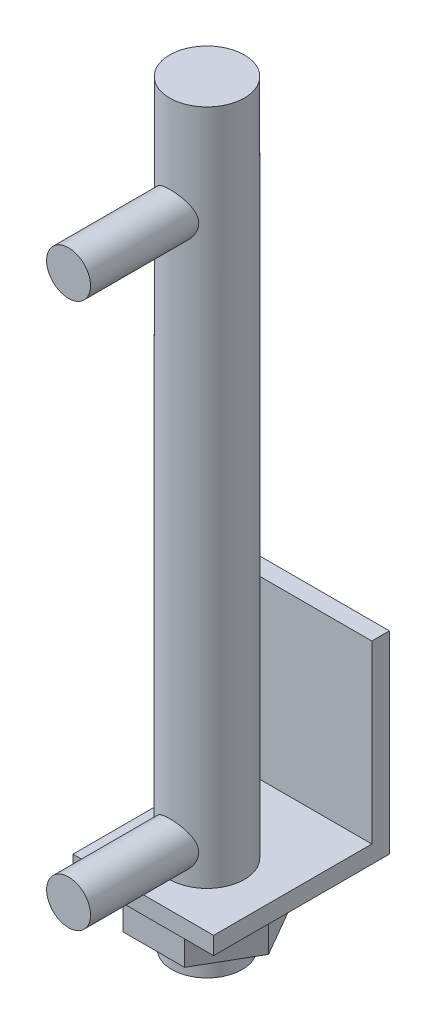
ISO-10303-21;
HEADER;
FILE_DESCRIPTION(('STEP AP214'),'2;1');
FILE_NAME('part.step','',(''),(''),'','','');
FILE_SCHEMA(('AUTOMOTIVE_DESIGN { 1 0 10303 214 1 1 1 1 }'));
ENDSEC;
DATA;
#1=APPLICATION_CONTEXT('core data for automotive mechanical design processes');
#2=APPLICATION_PROTOCOL_DEFINITION('international standard','automotive_design',2000,#1);
#3=PRODUCT_CONTEXT('',#1,'mechanical');
#4=PRODUCT('Part','Part','',(#3));
#5=PRODUCT_RELATED_PRODUCT_CATEGORY('part','',(#4));
#6=PRODUCT_DEFINITION_FORMATION('','',#4);
#7=PRODUCT_DEFINITION_CONTEXT('part definition',#1,'design');
#8=PRODUCT_DEFINITION('design','',#6,#7);
#9=PRODUCT_DEFINITION_SHAPE('','',#8);
#10=(LENGTH_UNIT() NAMED_UNIT(*) SI_UNIT(.MILLI.,.METRE.));
#11=(NAMED_UNIT(*) PLANE_ANGLE_UNIT() SI_UNIT($,.RADIAN.));
#12=(NAMED_UNIT(*) SI_UNIT($,.STERADIAN.) SOLID_ANGLE_UNIT());
#13=UNCERTAINTY_MEASURE_WITH_UNIT(LENGTH_MEASURE(1.E-05),#10,'distance_accuracy_value','');
#14=(GEOMETRIC_REPRESENTATION_CONTEXT(3) GLOBAL_UNCERTAINTY_ASSIGNED_CONTEXT((#13)) GLOBAL_UNIT_ASSIGNED_CONTEXT((#10,
#11,#12)) REPRESENTATION_CONTEXT('',''));
#15=CARTESIAN_POINT('',(0.,0.,0.));
#16=DIRECTION('',(0.,0.,1.));
#17=DIRECTION('',(1.,0.,0.));
#18=AXIS2_PLACEMENT_3D('',#15,#16,#17);
#19=CARTESIAN_POINT('',(0.,154.,0.));
#20=DIRECTION('',(0.,-1.,0.));
#21=DIRECTION('',(0.,0.,-1.));
#22=AXIS2_PLACEMENT_3D('',#19,#20,#21);
#23=CYLINDRICAL_SURFACE('',#22,8.5);
#24=CARTESIAN_POINT('',(-5.,7.,6.87386354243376));
#25=CARTESIAN_POINT('',(-5.00000015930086,6.87361152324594,6.87386328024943));
#26=CARTESIAN_POINT('',(-4.99520047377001,6.74722544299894,6.87736235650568));
#27=CARTESIAN_POINT('',(-4.97608962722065,6.49556010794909,6.89120233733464));
#28=CARTESIAN_POINT('',(-4.96177856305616,6.37028084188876,6.90154317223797));
#29=CARTESIAN_POINT('',(-4.92387022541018,6.12175760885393,6.92863932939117));
#30=CARTESIAN_POINT('',(-4.90026674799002,5.99851505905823,6.94539893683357));
#31=CARTESIAN_POINT('',(-4.84413070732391,5.75499473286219,6.98466632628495));
#32=CARTESIAN_POINT('',(-4.81159396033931,5.63471837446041,7.00717680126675));
#33=CARTESIAN_POINT('',(-4.70173229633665,5.28121872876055,7.0817754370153));
#34=CARTESIAN_POINT('',(-4.61183990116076,5.05331513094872,7.14117199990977));
#35=CARTESIAN_POINT('',(-4.40181230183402,4.61608744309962,7.2725046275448));
#36=CARTESIAN_POINT('',(-4.2816675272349,4.40676926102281,7.34444465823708));
#37=CARTESIAN_POINT('',(-3.9981483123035,3.98560780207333,7.50294471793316));
#38=CARTESIAN_POINT('',(-3.8313605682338,3.77633473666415,7.59023048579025));
#39=CARTESIAN_POINT('',(-3.46615404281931,3.38654010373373,7.76380092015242));
#40=CARTESIAN_POINT('',(-3.26771300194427,3.20603894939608,7.85008483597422));
#41=CARTESIAN_POINT('',(-2.93782109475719,2.95139729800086,7.97715958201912));
#42=CARTESIAN_POINT('',(-2.81619934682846,2.86584092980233,8.02101011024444));
#43=CARTESIAN_POINT('',(-2.56488101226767,2.70540031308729,8.10486891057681));
#44=CARTESIAN_POINT('',(-2.43518779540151,2.63051165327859,8.14487876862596));
#45=CARTESIAN_POINT('',(-2.16850723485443,2.49221443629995,8.21990024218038));
#46=CARTESIAN_POINT('',(-2.03152298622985,2.42880105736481,8.25491395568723));
#47=CARTESIAN_POINT('',(-1.75115979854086,2.31423880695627,8.31890005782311));
#48=CARTESIAN_POINT('',(-1.60778186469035,2.26308801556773,8.34787339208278));
#49=CARTESIAN_POINT('',(-1.32932369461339,2.17795757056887,8.39648677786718));
#50=CARTESIAN_POINT('',(-1.19470218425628,2.1428274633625,8.41674214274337));
#51=CARTESIAN_POINT('',(-0.922235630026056,2.08381209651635,8.45093624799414));
#52=CARTESIAN_POINT('',(-0.784391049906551,2.05992522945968,8.46487589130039));
#53=CARTESIAN_POINT('',(-0.506770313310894,2.02377998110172,8.48602091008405));
#54=CARTESIAN_POINT('',(-0.366995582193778,2.01151344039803,8.49323101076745));
#55=CARTESIAN_POINT('',(-0.086729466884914,1.99878518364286,8.50071301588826));
#56=CARTESIAN_POINT('',(0.0537618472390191,1.99832233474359,8.50098558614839));
#57=CARTESIAN_POINT('',(0.317330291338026,2.00855149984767,8.49497185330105));
#58=CARTESIAN_POINT('',(0.440479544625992,2.01791532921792,8.48946649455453));
#59=CARTESIAN_POINT('',(0.685443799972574,2.04567200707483,8.47320713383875));
#60=CARTESIAN_POINT('',(0.807258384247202,2.06406760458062,8.46245153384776));
#61=CARTESIAN_POINT('',(1.04863308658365,2.10965808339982,8.43594090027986));
#62=CARTESIAN_POINT('',(1.16819395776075,2.13684996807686,8.42018756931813));
#63=CARTESIAN_POINT('',(1.40436247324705,2.1997161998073,8.38403670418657));
#64=CARTESIAN_POINT('',(1.52096895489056,2.2353938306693,8.36363737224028));
#65=CARTESIAN_POINT('',(1.86684916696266,2.35515823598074,8.29579078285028));
#66=CARTESIAN_POINT('',(2.09069284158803,2.45169072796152,8.24186605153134));
#67=CARTESIAN_POINT('',(2.5191957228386,2.67425002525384,8.12116934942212));
#68=CARTESIAN_POINT('',(2.72384964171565,2.80028492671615,8.05439385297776));
#69=CARTESIAN_POINT('',(3.13396607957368,3.09497814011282,7.90450835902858));
#70=CARTESIAN_POINT('',(3.33672671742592,3.26689669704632,7.82040139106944));
#71=CARTESIAN_POINT('',(3.71219743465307,3.63996092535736,7.64933256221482));
#72=CARTESIAN_POINT('',(3.88486786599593,3.84114452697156,7.56236711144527));
#73=CARTESIAN_POINT('',(4.21435506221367,4.2934154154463,7.384303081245));
#74=CARTESIAN_POINT('',(4.36738665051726,4.54755257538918,7.29378878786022));
#75=CARTESIAN_POINT('',(4.56249844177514,4.94919813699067,7.17213498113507));
#76=CARTESIAN_POINT('',(4.62178663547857,5.08645227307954,7.13394390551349));
#77=CARTESIAN_POINT('',(4.72824603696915,5.36715673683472,7.06383370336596));
#78=CARTESIAN_POINT('',(4.77542179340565,5.51060471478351,7.03191222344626));
#79=CARTESIAN_POINT('',(4.84708756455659,5.76751548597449,6.98263217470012));
#80=CARTESIAN_POINT('',(4.87430483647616,5.87990928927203,6.96361723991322));
#81=CARTESIAN_POINT('',(4.92097885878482,6.10702902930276,6.93071316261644));
#82=CARTESIAN_POINT('',(4.94043724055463,6.22175447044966,6.91682294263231));
#83=CARTESIAN_POINT('',(4.97132228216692,6.45271802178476,6.89465862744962));
#84=CARTESIAN_POINT('',(4.98275607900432,6.56895469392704,6.88637954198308));
#85=CARTESIAN_POINT('',(4.99745325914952,6.80221976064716,6.87572137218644));
#86=CARTESIAN_POINT('',(5.00071645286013,6.91924817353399,6.87334242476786));
#87=CARTESIAN_POINT('',(4.99902030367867,7.15331083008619,6.87457613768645));
#88=CARTESIAN_POINT('',(4.99405412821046,7.27034499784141,6.87819377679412));
#89=CARTESIAN_POINT('',(4.97596011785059,7.50348698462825,6.89129481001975));
#90=CARTESIAN_POINT('',(4.96282929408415,7.61959444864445,6.90078035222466));
#91=CARTESIAN_POINT('',(4.92858602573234,7.85006638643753,6.92527848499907));
#92=CARTESIAN_POINT('',(4.90747135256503,7.96443036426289,6.94029261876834));
#93=CARTESIAN_POINT('',(4.8575385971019,8.1906985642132,6.97533099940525));
#94=CARTESIAN_POINT('',(4.82871739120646,8.30260176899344,6.99535727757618));
#95=CARTESIAN_POINT('',(4.73087760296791,8.63466281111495,7.06222982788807));
#96=CARTESIAN_POINT('',(4.65061879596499,8.85027628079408,7.11576680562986));
#97=CARTESIAN_POINT('',(4.46306838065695,9.26563262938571,7.23486753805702));
#98=CARTESIAN_POINT('',(4.35576623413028,9.46536928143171,7.30043597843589));
#99=CARTESIAN_POINT('',(4.09552588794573,9.88039621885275,7.45002972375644));
#100=CARTESIAN_POINT('',(3.93788949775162,10.092304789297,7.53527804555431));
#101=CARTESIAN_POINT('',(3.59127980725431,10.4888508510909,7.7064938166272));
#102=CARTESIAN_POINT('',(3.40227807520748,10.6734633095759,7.79246185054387));
#103=CARTESIAN_POINT('',(3.08561346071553,10.9371098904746,7.92111554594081));
#104=CARTESIAN_POINT('',(2.96763932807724,11.0268102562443,7.96617516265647));
#105=CARTESIAN_POINT('',(2.72336552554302,11.1958695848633,8.05295289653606));
#106=CARTESIAN_POINT('',(2.59706907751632,11.2752325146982,8.09467229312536));
#107=CARTESIAN_POINT('',(2.33684561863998,11.4228411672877,8.17359392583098));
#108=CARTESIAN_POINT('',(2.20292092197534,11.4910902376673,8.21079752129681));
#109=CARTESIAN_POINT('',(1.92826199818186,11.6156834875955,8.27960355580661));
#110=CARTESIAN_POINT('',(1.78752871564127,11.6720293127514,8.31120676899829));
#111=CARTESIAN_POINT('',(1.51137716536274,11.7681696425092,8.36564383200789));
#112=CARTESIAN_POINT('',(1.37638207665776,11.8089035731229,8.3889650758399));
#113=CARTESIAN_POINT('',(1.10255327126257,11.8789692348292,8.42932495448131));
#114=CARTESIAN_POINT('',(0.96372013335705,11.9083026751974,8.44636453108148));
#115=CARTESIAN_POINT('',(0.683518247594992,11.9550945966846,8.47364154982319));
#116=CARTESIAN_POINT('',(0.542151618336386,11.9725625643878,8.48388442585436));
#117=CARTESIAN_POINT('',(0.258114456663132,11.995364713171,8.49726907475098));
#118=CARTESIAN_POINT('',(0.115444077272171,12.0007003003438,8.50041167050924));
#119=CARTESIAN_POINT('',(-0.151711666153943,11.9992501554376,8.49955915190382));
#120=CARTESIAN_POINT('',(-0.276210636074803,11.9939146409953,8.49641799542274));
#121=CARTESIAN_POINT('',(-0.524249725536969,11.9739970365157,8.48472634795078));
#122=CARTESIAN_POINT('',(-0.647789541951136,11.9594121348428,8.47617421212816));
#123=CARTESIAN_POINT('',(-0.89293544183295,11.9211833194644,8.4538631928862));
#124=CARTESIAN_POINT('',(-1.01454223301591,11.8975428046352,8.44010626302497));
#125=CARTESIAN_POINT('',(-1.25507082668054,11.8414949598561,8.40770833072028));
#126=CARTESIAN_POINT('',(-1.37399157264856,11.809084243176,8.38906544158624));
#127=CARTESIAN_POINT('',(-1.72354346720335,11.6998431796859,8.32675827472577));
#128=CARTESIAN_POINT('',(-1.94927426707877,11.6106348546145,8.27649334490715));
#129=CARTESIAN_POINT('',(-2.38258507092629,11.4024109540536,8.16233248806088));
#130=CARTESIAN_POINT('',(-2.59016066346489,11.2833881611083,8.09843326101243));
#131=CARTESIAN_POINT('',(-3.00589419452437,11.0042439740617,7.95412679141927));
#132=CARTESIAN_POINT('',(-3.21162278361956,10.8410479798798,7.87267785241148));
#133=CARTESIAN_POINT('',(-3.59447885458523,10.4854095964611,7.70541511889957));
#134=CARTESIAN_POINT('',(-3.77157258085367,10.2929332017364,7.61959632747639));
#135=CARTESIAN_POINT('',(-4.02300871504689,9.9726656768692,7.48837711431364));
#136=CARTESIAN_POINT('',(-4.10824607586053,9.85373612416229,7.44182713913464));
#137=CARTESIAN_POINT('',(-4.26838282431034,9.608139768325,7.35114714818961));
#138=CARTESIAN_POINT('',(-4.34327960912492,9.48147102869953,7.30701774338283));
#139=CARTESIAN_POINT('',(-4.48203401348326,9.22106440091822,7.22273929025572));
#140=CARTESIAN_POINT('',(-4.54589842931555,9.08733093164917,7.1825877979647));
#141=CARTESIAN_POINT('',(-4.66191254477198,8.81346605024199,7.10783616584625));
#142=CARTESIAN_POINT('',(-4.71407062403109,8.67333930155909,7.0732320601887));
#143=CARTESIAN_POINT('',(-4.79920141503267,8.40856618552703,7.01568986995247));
#144=CARTESIAN_POINT('',(-4.83386750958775,8.28467365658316,6.99178455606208));
#145=CARTESIAN_POINT('',(-4.8936855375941,8.03366879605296,6.95004859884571));
#146=CARTESIAN_POINT('',(-4.91884309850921,7.90655841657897,6.93221436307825));
#147=CARTESIAN_POINT('',(-4.95924756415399,7.6501447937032,6.90336747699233));
#148=CARTESIAN_POINT('',(-4.97450547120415,7.52084414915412,6.8923472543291));
#149=CARTESIAN_POINT('',(-4.99488145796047,7.2610281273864,6.87759552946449));
#150=CARTESIAN_POINT('',(-4.99999983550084,7.13051278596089,6.87386381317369));
#151=CARTESIAN_POINT('',(-5.,7.,6.87386354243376));
#152=B_SPLINE_CURVE_WITH_KNOTS('',3,(#24,#25,#26,#27,#28,#29,#30,#31,#32,#33,#34,#35,#36,#37,
#38,#39,#40,#41,#42,#43,#44,#45,#46,#47,#48,#49,#50,#51,#52,#53,#54,#55,#56,#57,#58,#59,#60,#61,
#62,#63,#64,#65,#66,#67,#68,#69,#70,#71,#72,#73,#74,#75,#76,#77,#78,#79,#80,#81,#82,#83,#84,#85,
#86,#87,#88,#89,#90,#91,#92,#93,#94,#95,#96,#97,#98,#99,#100,#101,#102,#103,#104,#105,#106,#107,
#108,#109,#110,#111,#112,#113,#114,#115,#116,#117,#118,#119,#120,#121,#122,#123,#124,#125,#126,
#127,#128,#129,#130,#131,#132,#133,#134,#135,#136,#137,#138,#139,#140,#141,#142,#143,#144,#145,
#146,#147,#148,#149,#150,#151),.UNSPECIFIED.,.T.,.F.,(4,2,2,2,2,2,2,2,2,2,2,2,2,2,2,2,2,2,2,2,2,
2,2,2,2,2,2,2,2,2,2,2,2,2,2,2,2,2,2,2,2,2,2,2,2,2,2,2,2,2,2,2,2,2,2,2,2,2,2,2,2,2,2,4),(0.,
0.379023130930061,0.758042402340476,1.13731515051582,1.51676582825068,2.26959953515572,
3.02267170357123,3.86385803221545,4.70563853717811,5.17020411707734,5.63457702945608,
6.09875436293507,6.56285897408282,6.98404701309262,7.40517481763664,7.82600670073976,
8.24679819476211,8.61723697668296,8.98778857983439,9.35821407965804,9.72878316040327,
10.4744507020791,11.2203231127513,12.0533830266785,12.8875324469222,13.8126919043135,
14.2750562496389,14.7372467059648,15.0884778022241,15.439635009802,15.7904795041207,
16.1413321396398,16.4924762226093,16.84374892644,17.1951197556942,17.5466332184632,
18.2523650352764,18.9583722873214,19.7877574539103,20.6178985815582,21.0820898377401,
21.5461024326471,22.00997500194,22.4737833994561,22.9019345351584,23.330021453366,
23.757765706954,24.1854603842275,24.5589622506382,24.9325777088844,25.3060530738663,
25.6796728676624,26.4199474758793,27.160401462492,27.9820049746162,28.8045700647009,
29.2647382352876,29.725022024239,30.1850212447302,30.6446901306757,31.0367616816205,
31.4286008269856,31.8200037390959,32.2113951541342),.UNSPECIFIED.);
#153=CARTESIAN_POINT('',(-5.,7.,6.87386354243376));
#154=VERTEX_POINT('',#153);
#155=EDGE_CURVE('E42',#154,#154,#152,.T.);
#156=ORIENTED_EDGE('',*,*,#155,.F.);
#157=EDGE_LOOP('',(#156));
#158=FACE_BOUND('',#157,.T.);
#159=CARTESIAN_POINT('',(0.,154.,0.));
#160=DIRECTION('',(0.,1.,0.));
#161=DIRECTION('',(0.,0.,1.));
#162=AXIS2_PLACEMENT_3D('',#159,#160,#161);
#163=CIRCLE('',#162,8.5);
#164=CARTESIAN_POINT('',(0.,154.,8.5));
#165=VERTEX_POINT('',#164);
#166=EDGE_CURVE('E200',#165,#165,#163,.T.);
#167=ORIENTED_EDGE('',*,*,#166,.F.);
#168=EDGE_LOOP('',(#167));
#169=FACE_BOUND('',#168,.T.);
#170=CARTESIAN_POINT('',(0.,0.,0.));
#171=DIRECTION('',(0.,-1.,0.));
#172=DIRECTION('',(0.,0.,-1.));
#173=AXIS2_PLACEMENT_3D('',#170,#171,#172);
#174=CIRCLE('',#173,8.5);
#175=CARTESIAN_POINT('',(0.,0.,-8.5));
#176=VERTEX_POINT('',#175);
#177=EDGE_CURVE('E197',#176,#176,#174,.T.);
#178=ORIENTED_EDGE('',*,*,#177,.F.);
#179=EDGE_LOOP('',(#178));
#180=FACE_BOUND('',#179,.T.);
#181=CARTESIAN_POINT('',(-5.,131.,6.87386354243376));
#182=CARTESIAN_POINT('',(-5.00000015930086,130.873611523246,6.87386328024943));
#183=CARTESIAN_POINT('',(-4.99520047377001,130.747225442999,6.87736235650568));
#184=CARTESIAN_POINT('',(-4.97608962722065,130.495560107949,6.89120233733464));
#185=CARTESIAN_POINT('',(-4.96177856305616,130.370280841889,6.90154317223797));
#186=CARTESIAN_POINT('',(-4.92387022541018,130.121757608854,6.92863932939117));
#187=CARTESIAN_POINT('',(-4.90026674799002,129.998515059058,6.94539893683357));
#188=CARTESIAN_POINT('',(-4.84413070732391,129.754994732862,6.98466632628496));
#189=CARTESIAN_POINT('',(-4.8115939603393,129.63471837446,7.00717680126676));
#190=CARTESIAN_POINT('',(-4.70173229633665,129.281218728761,7.0817754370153));
#191=CARTESIAN_POINT('',(-4.61183990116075,129.053315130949,7.14117199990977));
#192=CARTESIAN_POINT('',(-4.40181230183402,128.6160874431,7.2725046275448));
#193=CARTESIAN_POINT('',(-4.2816675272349,128.406769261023,7.34444465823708));
#194=CARTESIAN_POINT('',(-3.99814831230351,127.985607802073,7.50294471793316));
#195=CARTESIAN_POINT('',(-3.83136056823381,127.776334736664,7.59023048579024));
#196=CARTESIAN_POINT('',(-3.46615404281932,127.386540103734,7.76380092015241));
#197=CARTESIAN_POINT('',(-3.26771300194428,127.206038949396,7.85008483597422));
#198=CARTESIAN_POINT('',(-2.93782109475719,126.951397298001,7.97715958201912));
#199=CARTESIAN_POINT('',(-2.81619934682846,126.865840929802,8.02101011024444));
#200=CARTESIAN_POINT('',(-2.56488101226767,126.705400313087,8.10486891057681));
#201=CARTESIAN_POINT('',(-2.43518779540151,126.630511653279,8.14487876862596));
#202=CARTESIAN_POINT('',(-2.16850723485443,126.4922144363,8.21990024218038));
#203=CARTESIAN_POINT('',(-2.03152298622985,126.428801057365,8.25491395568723));
#204=CARTESIAN_POINT('',(-1.75115979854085,126.314238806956,8.31890005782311));
#205=CARTESIAN_POINT('',(-1.60778186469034,126.263088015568,8.34787339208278));
#206=CARTESIAN_POINT('',(-1.32932369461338,126.177957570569,8.39648677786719));
#207=CARTESIAN_POINT('',(-1.19470218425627,126.142827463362,8.41674214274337));
#208=CARTESIAN_POINT('',(-0.922235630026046,126.083812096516,8.45093624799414));
#209=CARTESIAN_POINT('',(-0.784391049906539,126.05992522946,8.4648758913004));
#210=CARTESIAN_POINT('',(-0.506770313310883,126.023779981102,8.48602091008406));
#211=CARTESIAN_POINT('',(-0.366995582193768,126.011513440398,8.49323101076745));
#212=CARTESIAN_POINT('',(-0.0867294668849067,125.998785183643,8.50071301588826));
#213=CARTESIAN_POINT('',(0.0537618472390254,125.998322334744,8.50098558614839));
#214=CARTESIAN_POINT('',(0.317330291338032,126.008551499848,8.49497185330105));
#215=CARTESIAN_POINT('',(0.440479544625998,126.017915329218,8.48946649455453));
#216=CARTESIAN_POINT('',(0.68544379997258,126.045672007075,8.47320713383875));
#217=CARTESIAN_POINT('',(0.807258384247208,126.064067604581,8.46245153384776));
#218=CARTESIAN_POINT('',(1.04863308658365,126.1096580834,8.43594090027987));
#219=CARTESIAN_POINT('',(1.16819395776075,126.136849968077,8.42018756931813));
#220=CARTESIAN_POINT('',(1.40436247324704,126.199716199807,8.38403670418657));
#221=CARTESIAN_POINT('',(1.52096895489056,126.235393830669,8.36363737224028));
#222=CARTESIAN_POINT('',(1.86684916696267,126.355158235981,8.29579078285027));
#223=CARTESIAN_POINT('',(2.09069284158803,126.451690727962,8.24186605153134));
#224=CARTESIAN_POINT('',(2.5191957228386,126.674250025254,8.12116934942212));
#225=CARTESIAN_POINT('',(2.72384964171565,126.800284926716,8.05439385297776));
#226=CARTESIAN_POINT('',(3.13396607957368,127.094978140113,7.90450835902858));
#227=CARTESIAN_POINT('',(3.33672671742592,127.266896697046,7.82040139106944));
#228=CARTESIAN_POINT('',(3.71219743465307,127.639960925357,7.64933256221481));
#229=CARTESIAN_POINT('',(3.88486786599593,127.841144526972,7.56236711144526));
#230=CARTESIAN_POINT('',(4.21435506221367,128.293415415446,7.384303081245));
#231=CARTESIAN_POINT('',(4.36738665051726,128.547552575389,7.29378878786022));
#232=CARTESIAN_POINT('',(4.56249844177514,128.949198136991,7.17213498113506));
#233=CARTESIAN_POINT('',(4.62178663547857,129.08645227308,7.13394390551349));
#234=CARTESIAN_POINT('',(4.72824603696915,129.367156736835,7.06383370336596));
#235=CARTESIAN_POINT('',(4.77542179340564,129.510604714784,7.03191222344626));
#236=CARTESIAN_POINT('',(4.84708756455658,129.767515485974,6.98263217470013));
#237=CARTESIAN_POINT('',(4.87430483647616,129.879909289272,6.96361723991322));
#238=CARTESIAN_POINT('',(4.92097885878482,130.107029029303,6.93071316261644));
#239=CARTESIAN_POINT('',(4.94043724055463,130.22175447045,6.91682294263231));
#240=CARTESIAN_POINT('',(4.97132228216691,130.452718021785,6.89465862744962));
#241=CARTESIAN_POINT('',(4.98275607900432,130.568954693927,6.88637954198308));
#242=CARTESIAN_POINT('',(4.99745325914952,130.802219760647,6.87572137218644));
#243=CARTESIAN_POINT('',(5.00071645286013,130.919248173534,6.87334242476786));
#244=CARTESIAN_POINT('',(4.99902030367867,131.153310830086,6.87457613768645));
#245=CARTESIAN_POINT('',(4.99405412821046,131.270344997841,6.87819377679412));
#246=CARTESIAN_POINT('',(4.97596011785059,131.503486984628,6.89129481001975));
#247=CARTESIAN_POINT('',(4.96282929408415,131.619594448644,6.90078035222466));
#248=CARTESIAN_POINT('',(4.92858602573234,131.850066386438,6.92527848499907));
#249=CARTESIAN_POINT('',(4.90747135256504,131.964430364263,6.94029261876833));
#250=CARTESIAN_POINT('',(4.85753859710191,132.190698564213,6.97533099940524));
#251=CARTESIAN_POINT('',(4.82871739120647,132.302601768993,6.99535727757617));
#252=CARTESIAN_POINT('',(4.73087760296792,132.634662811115,7.06222982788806));
#253=CARTESIAN_POINT('',(4.650618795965,132.850276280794,7.11576680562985));
#254=CARTESIAN_POINT('',(4.46306838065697,133.265632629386,7.23486753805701));
#255=CARTESIAN_POINT('',(4.35576623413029,133.465369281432,7.30043597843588));
#256=CARTESIAN_POINT('',(4.09552588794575,133.880396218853,7.45002972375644));
#257=CARTESIAN_POINT('',(3.93788949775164,134.092304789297,7.53527804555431));
#258=CARTESIAN_POINT('',(3.59127980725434,134.488850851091,7.70649381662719));
#259=CARTESIAN_POINT('',(3.40227807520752,134.673463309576,7.79246185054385));
#260=CARTESIAN_POINT('',(3.08561346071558,134.937109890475,7.9211155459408));
#261=CARTESIAN_POINT('',(2.96763932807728,135.026810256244,7.96617516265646));
#262=CARTESIAN_POINT('',(2.72336552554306,135.195869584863,8.05295289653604));
#263=CARTESIAN_POINT('',(2.59706907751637,135.275232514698,8.09467229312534));
#264=CARTESIAN_POINT('',(2.33684561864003,135.422841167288,8.17359392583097));
#265=CARTESIAN_POINT('',(2.20292092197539,135.491090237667,8.2107975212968));
#266=CARTESIAN_POINT('',(1.92826199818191,135.615683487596,8.2796035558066));
#267=CARTESIAN_POINT('',(1.78752871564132,135.672029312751,8.31120676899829));
#268=CARTESIAN_POINT('',(1.51137716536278,135.768169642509,8.36564383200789));
#269=CARTESIAN_POINT('',(1.3763820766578,135.808903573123,8.38896507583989));
#270=CARTESIAN_POINT('',(1.10255327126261,135.878969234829,8.4293249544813));
#271=CARTESIAN_POINT('',(0.963720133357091,135.908302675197,8.44636453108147));
#272=CARTESIAN_POINT('',(0.68351824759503,135.955094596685,8.47364154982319));
#273=CARTESIAN_POINT('',(0.542151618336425,135.972562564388,8.48388442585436));
#274=CARTESIAN_POINT('',(0.25811445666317,135.995364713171,8.49726907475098));
#275=CARTESIAN_POINT('',(0.115444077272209,136.000700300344,8.50041167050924));
#276=CARTESIAN_POINT('',(-0.151711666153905,135.999250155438,8.49955915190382));
#277=CARTESIAN_POINT('',(-0.276210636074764,135.993914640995,8.49641799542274));
#278=CARTESIAN_POINT('',(-0.524249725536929,135.973997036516,8.48472634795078));
#279=CARTESIAN_POINT('',(-0.647789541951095,135.959412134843,8.47617421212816));
#280=CARTESIAN_POINT('',(-0.892935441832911,135.921183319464,8.4538631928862));
#281=CARTESIAN_POINT('',(-1.01454223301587,135.897542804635,8.44010626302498));
#282=CARTESIAN_POINT('',(-1.25507082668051,135.841494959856,8.40770833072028));
#283=CARTESIAN_POINT('',(-1.37399157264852,135.809084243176,8.38906544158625));
#284=CARTESIAN_POINT('',(-1.72354346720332,135.699843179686,8.32675827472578));
#285=CARTESIAN_POINT('',(-1.94927426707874,135.610634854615,8.27649334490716));
#286=CARTESIAN_POINT('',(-2.38258507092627,135.402410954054,8.16233248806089));
#287=CARTESIAN_POINT('',(-2.59016066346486,135.283388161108,8.09843326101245));
#288=CARTESIAN_POINT('',(-3.00589419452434,135.004243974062,7.95412679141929));
#289=CARTESIAN_POINT('',(-3.21162278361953,134.84104797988,7.87267785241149));
#290=CARTESIAN_POINT('',(-3.5944788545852,134.485409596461,7.70541511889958));
#291=CARTESIAN_POINT('',(-3.77157258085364,134.292933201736,7.61959632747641));
#292=CARTESIAN_POINT('',(-4.02300871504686,133.972665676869,7.48837711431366));
#293=CARTESIAN_POINT('',(-4.1082460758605,133.853736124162,7.44182713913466));
#294=CARTESIAN_POINT('',(-4.26838282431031,133.608139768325,7.35114714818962));
#295=CARTESIAN_POINT('',(-4.3432796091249,133.4814710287,7.30701774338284));
#296=CARTESIAN_POINT('',(-4.48203401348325,133.221064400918,7.22273929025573));
#297=CARTESIAN_POINT('',(-4.54589842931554,133.087330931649,7.18258779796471));
#298=CARTESIAN_POINT('',(-4.66191254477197,132.813466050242,7.10783616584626));
#299=CARTESIAN_POINT('',(-4.71407062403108,132.673339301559,7.07323206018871));
#300=CARTESIAN_POINT('',(-4.79920141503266,132.408566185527,7.01568986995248));
#301=CARTESIAN_POINT('',(-4.83386750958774,132.284673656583,6.99178455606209));
#302=CARTESIAN_POINT('',(-4.89368553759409,132.033668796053,6.95004859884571));
#303=CARTESIAN_POINT('',(-4.91884309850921,131.906558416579,6.93221436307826));
#304=CARTESIAN_POINT('',(-4.95924756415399,131.650144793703,6.90336747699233));
#305=CARTESIAN_POINT('',(-4.97450547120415,131.520844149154,6.8923472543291));
#306=CARTESIAN_POINT('',(-4.99488145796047,131.261028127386,6.87759552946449));
#307=CARTESIAN_POINT('',(-4.99999983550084,131.130512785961,6.87386381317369));
#308=CARTESIAN_POINT('',(-5.,131.,6.87386354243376));
#309=B_SPLINE_CURVE_WITH_KNOTS('',3,(#181,#182,#183,#184,#185,#186,#187,#188,#189,#190,#191,
#192,#193,#194,#195,#196,#197,#198,#199,#200,#201,#202,#203,#204,#205,#206,#207,#208,#209,#210,
#211,#212,#213,#214,#215,#216,#217,#218,#219,#220,#221,#222,#223,#224,#225,#226,#227,#228,#229,
#230,#231,#232,#233,#234,#235,#236,#237,#238,#239,#240,#241,#242,#243,#244,#245,#246,#247,#248,
#249,#250,#251,#252,#253,#254,#255,#256,#257,#258,#259,#260,#261,#262,#263,#264,#265,#266,#267,
#268,#269,#270,#271,#272,#273,#274,#275,#276,#277,#278,#279,#280,#281,#282,#283,#284,#285,#286,
#287,#288,#289,#290,#291,#292,#293,#294,#295,#296,#297,#298,#299,#300,#301,#302,#303,#304,#305,
#306,#307,#308),.UNSPECIFIED.,.T.,.F.,(4,2,2,2,2,2,2,2,2,2,2,2,2,2,2,2,2,2,2,2,2,2,2,2,2,2,2,2,
2,2,2,2,2,2,2,2,2,2,2,2,2,2,2,2,2,2,2,2,2,2,2,2,2,2,2,2,2,2,2,2,2,2,2,4),(0.,0.379023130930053,
0.758042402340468,1.13731515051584,1.51676582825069,2.26959953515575,3.02267170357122,
3.86385803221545,4.7056385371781,5.17020411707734,5.63457702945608,6.09875436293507,
6.56285897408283,6.98404701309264,7.40517481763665,7.82600670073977,8.24679819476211,
8.61723697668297,8.98778857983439,9.35821407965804,9.72878316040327,10.4744507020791,
11.2203231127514,12.0533830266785,12.8875324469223,13.8126919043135,14.2750562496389,
14.7372467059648,15.0884778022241,15.439635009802,15.7904795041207,16.1413321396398,
16.4924762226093,16.8437489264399,17.1951197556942,17.5466332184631,18.2523650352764,
18.9583722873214,19.7877574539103,20.6178985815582,21.0820898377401,21.546102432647,
22.00997500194,22.473783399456,22.9019345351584,23.3300214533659,23.757765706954,
24.1854603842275,24.5589622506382,24.9325777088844,25.3060530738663,25.6796728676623,
26.4199474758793,27.160401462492,27.9820049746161,28.8045700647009,29.2647382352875,
29.725022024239,30.1850212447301,30.6446901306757,31.0367616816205,31.4286008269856,
31.8200037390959,32.2113951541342),.UNSPECIFIED.);
#310=CARTESIAN_POINT('',(-5.,131.,6.87386354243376));
#311=VERTEX_POINT('',#310);
#312=EDGE_CURVE('E11',#311,#311,#309,.T.);
#313=ORIENTED_EDGE('',*,*,#312,.F.);
#314=EDGE_LOOP('',(#313));
#315=FACE_BOUND('',#314,.T.);
#316=ADVANCED_FACE('F31',(#158,#169,#180,#315),#23,.T.);
#317=CARTESIAN_POINT('',(14.,-12.,0.));
#318=DIRECTION('',(0.,-1.,0.));
#319=DIRECTION('',(0.,0.,-1.));
#320=AXIS2_PLACEMENT_3D('',#317,#318,#319);
#321=PLANE('',#320);
#322=DIRECTION('',(0.5,0.,0.866025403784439));
#323=VECTOR('',#322,1.);
#324=CARTESIAN_POINT('',(7.,-12.,-12.1243556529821));
#325=LINE('',#324,#323);
#326=CARTESIAN_POINT('',(7.,-12.,-12.1243556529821));
#327=VERTEX_POINT('',#326);
#328=CARTESIAN_POINT('',(14.,-12.,0.));
#329=VERTEX_POINT('',#328);
#330=EDGE_CURVE('E135',#327,#329,#325,.T.);
#331=ORIENTED_EDGE('',*,*,#330,.T.);
#332=DIRECTION('',(-0.5,0.,0.866025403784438));
#333=VECTOR('',#332,1.);
#334=CARTESIAN_POINT('',(14.,-12.,0.));
#335=LINE('',#334,#333);
#336=CARTESIAN_POINT('',(6.99999999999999,-12.,12.1243556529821));
#337=VERTEX_POINT('',#336);
#338=EDGE_CURVE('E124',#329,#337,#335,.T.);
#339=ORIENTED_EDGE('',*,*,#338,.T.);
#340=DIRECTION('',(-1.,0.,0.));
#341=VECTOR('',#340,1.);
#342=CARTESIAN_POINT('',(6.99999999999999,-12.,12.1243556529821));
#343=LINE('',#342,#341);
#344=CARTESIAN_POINT('',(-7.,-12.,12.1243556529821));
#345=VERTEX_POINT('',#344);
#346=EDGE_CURVE('E134',#337,#345,#343,.T.);
#347=ORIENTED_EDGE('',*,*,#346,.T.);
#348=DIRECTION('',(-0.5,0.,-0.866025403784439));
#349=VECTOR('',#348,1.);
#350=CARTESIAN_POINT('',(-7.,-12.,12.1243556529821));
#351=LINE('',#350,#349);
#352=CARTESIAN_POINT('',(-14.,-12.,0.));
#353=VERTEX_POINT('',#352);
#354=EDGE_CURVE('E316',#345,#353,#351,.T.);
#355=ORIENTED_EDGE('',*,*,#354,.T.);
#356=DIRECTION('',(0.5,0.,-0.866025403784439));
#357=VECTOR('',#356,1.);
#358=CARTESIAN_POINT('',(-14.,-12.,0.));
#359=LINE('',#358,#357);
#360=CARTESIAN_POINT('',(-7.,-12.,-12.1243556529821));
#361=VERTEX_POINT('',#360);
#362=EDGE_CURVE('E318',#353,#361,#359,.T.);
#363=ORIENTED_EDGE('',*,*,#362,.T.);
#364=DIRECTION('',(1.,0.,0.));
#365=VECTOR('',#364,1.);
#366=CARTESIAN_POINT('',(-7.,-12.,-12.1243556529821));
#367=LINE('',#366,#365);
#368=EDGE_CURVE('E140',#361,#327,#367,.T.);
#369=ORIENTED_EDGE('',*,*,#368,.T.);
#370=EDGE_LOOP('',(#331,#339,#347,#355,#363,#369));
#371=FACE_BOUND('',#370,.T.);
#372=CARTESIAN_POINT('',(0.,-12.,0.));
#373=DIRECTION('',(0.,-1.,0.));
#374=DIRECTION('',(0.,0.,-1.));
#375=AXIS2_PLACEMENT_3D('',#372,#373,#374);
#376=CIRCLE('',#375,8.);
#377=CARTESIAN_POINT('',(0.,-12.,-8.));
#378=VERTEX_POINT('',#377);
#379=EDGE_CURVE('E203',#378,#378,#376,.F.);
#380=ORIENTED_EDGE('',*,*,#379,.T.);
#381=EDGE_LOOP('',(#380));
#382=FACE_BOUND('',#381,.T.);
#383=ADVANCED_FACE('F138',(#371,#382),#321,.T.);
#384=CARTESIAN_POINT('',(-16.,-4.,-25.5));
#385=DIRECTION('',(0.,-1.,0.));
#386=DIRECTION('',(0.,0.,-1.));
#387=AXIS2_PLACEMENT_3D('',#384,#385,#386);
#388=PLANE('',#387);
#389=DIRECTION('',(0.,0.,-1.));
#390=VECTOR('',#389,1.);
#391=CARTESIAN_POINT('',(-16.,-4.,14.5));
#392=LINE('',#391,#390);
#393=CARTESIAN_POINT('',(-16.,-4.,14.5));
#394=VERTEX_POINT('',#393);
#395=CARTESIAN_POINT('',(-16.,-4.,-25.5));
#396=VERTEX_POINT('',#395);
#397=EDGE_CURVE('E172',#394,#396,#392,.T.);
#398=ORIENTED_EDGE('',*,*,#397,.T.);
#399=DIRECTION('',(1.,0.,0.));
#400=VECTOR('',#399,1.);
#401=CARTESIAN_POINT('',(-16.,-4.,-25.5));
#402=LINE('',#401,#400);
#403=CARTESIAN_POINT('',(16.,-4.,-25.5));
#404=VERTEX_POINT('',#403);
#405=EDGE_CURVE('E175',#396,#404,#402,.T.);
#406=ORIENTED_EDGE('',*,*,#405,.T.);
#407=DIRECTION('',(0.,0.,1.));
#408=VECTOR('',#407,1.);
#409=CARTESIAN_POINT('',(16.,-4.,14.5));
#410=LINE('',#409,#408);
#411=CARTESIAN_POINT('',(16.,-4.,14.5));
#412=VERTEX_POINT('',#411);
#413=EDGE_CURVE('E178',#404,#412,#410,.T.);
#414=ORIENTED_EDGE('',*,*,#413,.T.);
#415=DIRECTION('',(-1.,0.,0.));
#416=VECTOR('',#415,1.);
#417=CARTESIAN_POINT('',(-16.,-4.,14.5));
#418=LINE('',#417,#416);
#419=EDGE_CURVE('E180',#412,#394,#418,.T.);
#420=ORIENTED_EDGE('',*,*,#419,.T.);
#421=EDGE_LOOP('',(#398,#406,#414,#420));
#422=FACE_BOUND('',#421,.T.);
#423=DIRECTION('',(-0.5,0.,0.866025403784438));
#424=VECTOR('',#423,1.);
#425=CARTESIAN_POINT('',(14.,-4.,0.));
#426=LINE('',#425,#424);
#427=CARTESIAN_POINT('',(14.,-4.,0.));
#428=VERTEX_POINT('',#427);
#429=CARTESIAN_POINT('',(6.99999999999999,-4.,12.1243556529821));
#430=VERTEX_POINT('',#429);
#431=EDGE_CURVE('E323',#428,#430,#426,.T.);
#432=ORIENTED_EDGE('',*,*,#431,.F.);
#433=DIRECTION('',(0.5,0.,0.866025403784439));
#434=VECTOR('',#433,1.);
#435=CARTESIAN_POINT('',(7.,-4.,-12.1243556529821));
#436=LINE('',#435,#434);
#437=CARTESIAN_POINT('',(7.,-4.,-12.1243556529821));
#438=VERTEX_POINT('',#437);
#439=EDGE_CURVE('E148',#438,#428,#436,.T.);
#440=ORIENTED_EDGE('',*,*,#439,.F.);
#441=DIRECTION('',(1.,0.,0.));
#442=VECTOR('',#441,1.);
#443=CARTESIAN_POINT('',(-7.,-4.,-12.1243556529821));
#444=LINE('',#443,#442);
#445=CARTESIAN_POINT('',(-7.,-4.,-12.1243556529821));
#446=VERTEX_POINT('',#445);
#447=EDGE_CURVE('E144',#446,#438,#444,.T.);
#448=ORIENTED_EDGE('',*,*,#447,.F.);
#449=DIRECTION('',(0.5,0.,-0.866025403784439));
#450=VECTOR('',#449,1.);
#451=CARTESIAN_POINT('',(-14.,-4.,0.));
#452=LINE('',#451,#450);
#453=CARTESIAN_POINT('',(-14.,-4.,0.));
#454=VERTEX_POINT('',#453);
#455=EDGE_CURVE('E329',#454,#446,#452,.T.);
#456=ORIENTED_EDGE('',*,*,#455,.F.);
#457=DIRECTION('',(-0.5,0.,-0.866025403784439));
#458=VECTOR('',#457,1.);
#459=CARTESIAN_POINT('',(-7.,-4.,12.1243556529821));
#460=LINE('',#459,#458);
#461=CARTESIAN_POINT('',(-7.,-4.,12.1243556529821));
#462=VERTEX_POINT('',#461);
#463=EDGE_CURVE('E327',#462,#454,#460,.T.);
#464=ORIENTED_EDGE('',*,*,#463,.F.);
#465=DIRECTION('',(-1.,0.,0.));
#466=VECTOR('',#465,1.);
#467=CARTESIAN_POINT('',(6.99999999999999,-4.,12.1243556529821));
#468=LINE('',#467,#466);
#469=EDGE_CURVE('E325',#430,#462,#468,.T.);
#470=ORIENTED_EDGE('',*,*,#469,.F.);
#471=EDGE_LOOP('',(#432,#440,#448,#456,#464,#470));
#472=FACE_BOUND('',#471,.T.);
#473=ADVANCED_FACE('F228',(#422,#472),#388,.T.);
#474=CARTESIAN_POINT('',(-16.,0.,-25.5));
#475=DIRECTION('',(0.,-1.,0.));
#476=DIRECTION('',(0.,0.,-1.));
#477=AXIS2_PLACEMENT_3D('',#474,#475,#476);
#478=PLANE('',#477);
#479=ORIENTED_EDGE('',*,*,#177,.T.);
#480=EDGE_LOOP('',(#479));
#481=FACE_BOUND('',#480,.T.);
#482=DIRECTION('',(1.,0.,0.));
#483=VECTOR('',#482,1.);
#484=CARTESIAN_POINT('',(-16.,0.,-21.5));
#485=LINE('',#484,#483);
#486=CARTESIAN_POINT('',(-16.,0.,-21.5));
#487=VERTEX_POINT('',#486);
#488=CARTESIAN_POINT('',(16.,0.,-21.5));
#489=VERTEX_POINT('',#488);
#490=EDGE_CURVE('E150',#487,#489,#485,.T.);
#491=ORIENTED_EDGE('',*,*,#490,.F.);
#492=DIRECTION('',(0.,0.,-1.));
#493=VECTOR('',#492,1.);
#494=CARTESIAN_POINT('',(-16.,0.,14.5));
#495=LINE('',#494,#493);
#496=CARTESIAN_POINT('',(-16.,0.,14.5));
#497=VERTEX_POINT('',#496);
#498=EDGE_CURVE('E171',#497,#487,#495,.T.);
#499=ORIENTED_EDGE('',*,*,#498,.F.);
#500=DIRECTION('',(-1.,0.,0.));
#501=VECTOR('',#500,1.);
#502=CARTESIAN_POINT('',(-16.,0.,14.5));
#503=LINE('',#502,#501);
#504=CARTESIAN_POINT('',(16.,0.,14.5));
#505=VERTEX_POINT('',#504);
#506=EDGE_CURVE('E176',#505,#497,#503,.T.);
#507=ORIENTED_EDGE('',*,*,#506,.F.);
#508=DIRECTION('',(0.,0.,1.));
#509=VECTOR('',#508,1.);
#510=CARTESIAN_POINT('',(16.,0.,14.5));
#511=LINE('',#510,#509);
#512=EDGE_CURVE('E185',#489,#505,#511,.T.);
#513=ORIENTED_EDGE('',*,*,#512,.F.);
#514=EDGE_LOOP('',(#491,#499,#507,#513));
#515=FACE_BOUND('',#514,.T.);
#516=ADVANCED_FACE('F258',(#481,#515),#478,.F.);
#517=CARTESIAN_POINT('',(0.,154.,0.));
#518=DIRECTION('',(0.,1.,0.));
#519=DIRECTION('',(0.,0.,1.));
#520=AXIS2_PLACEMENT_3D('',#517,#518,#519);
#521=PLANE('',#520);
#522=ORIENTED_EDGE('',*,*,#166,.T.);
#523=EDGE_LOOP('',(#522));
#524=FACE_BOUND('',#523,.T.);
#525=ADVANCED_FACE('F262',(#524),#521,.T.);
#526=CARTESIAN_POINT('',(-16.,-4.,14.5));
#527=DIRECTION('',(1.,0.,0.));
#528=DIRECTION('',(0.,0.,-1.));
#529=AXIS2_PLACEMENT_3D('',#526,#527,#528);
#530=PLANE('',#529);
#531=ORIENTED_EDGE('',*,*,#498,.T.);
#532=DIRECTION('',(0.,-1.,0.));
#533=VECTOR('',#532,1.);
#534=CARTESIAN_POINT('',(-16.,40.,-21.5));
#535=LINE('',#534,#533);
#536=CARTESIAN_POINT('',(-16.,40.,-21.5));
#537=VERTEX_POINT('',#536);
#538=EDGE_CURVE('E169',#537,#487,#535,.T.);
#539=ORIENTED_EDGE('',*,*,#538,.F.);
#540=DIRECTION('',(0.,0.,1.));
#541=VECTOR('',#540,1.);
#542=CARTESIAN_POINT('',(-16.,40.,-25.5));
#543=LINE('',#542,#541);
#544=CARTESIAN_POINT('',(-16.,40.,-25.5));
#545=VERTEX_POINT('',#544);
#546=EDGE_CURVE('E152',#545,#537,#543,.T.);
#547=ORIENTED_EDGE('',*,*,#546,.F.);
#548=DIRECTION('',(0.,1.,0.));
#549=VECTOR('',#548,1.);
#550=CARTESIAN_POINT('',(-16.,-4.,-25.5));
#551=LINE('',#550,#549);
#552=EDGE_CURVE('E195',#396,#545,#551,.T.);
#553=ORIENTED_EDGE('',*,*,#552,.F.);
#554=ORIENTED_EDGE('',*,*,#397,.F.);
#555=DIRECTION('',(0.,1.,0.));
#556=VECTOR('',#555,1.);
#557=CARTESIAN_POINT('',(-16.,-4.,14.5));
#558=LINE('',#557,#556);
#559=EDGE_CURVE('E182',#394,#497,#558,.T.);
#560=ORIENTED_EDGE('',*,*,#559,.T.);
#561=EDGE_LOOP('',(#531,#539,#547,#553,#554,#560));
#562=FACE_BOUND('',#561,.T.);
#563=ADVANCED_FACE('F273',(#562),#530,.F.);
#564=CARTESIAN_POINT('',(-16.,-4.,-25.5));
#565=DIRECTION('',(0.,0.,1.));
#566=DIRECTION('',(1.,0.,0.));
#567=AXIS2_PLACEMENT_3D('',#564,#565,#566);
#568=PLANE('',#567);
#569=ORIENTED_EDGE('',*,*,#552,.T.);
#570=DIRECTION('',(-1.,0.,0.));
#571=VECTOR('',#570,1.);
#572=CARTESIAN_POINT('',(-16.,40.,-25.5));
#573=LINE('',#572,#571);
#574=CARTESIAN_POINT('',(16.,40.,-25.5));
#575=VERTEX_POINT('',#574);
#576=EDGE_CURVE('E165',#575,#545,#573,.T.);
#577=ORIENTED_EDGE('',*,*,#576,.F.);
#578=DIRECTION('',(0.,1.,0.));
#579=VECTOR('',#578,1.);
#580=CARTESIAN_POINT('',(16.,-4.,-25.5));
#581=LINE('',#580,#579);
#582=EDGE_CURVE('E193',#404,#575,#581,.T.);
#583=ORIENTED_EDGE('',*,*,#582,.F.);
#584=ORIENTED_EDGE('',*,*,#405,.F.);
#585=EDGE_LOOP('',(#569,#577,#583,#584));
#586=FACE_BOUND('',#585,.T.);
#587=ADVANCED_FACE('F270',(#586),#568,.F.);
#588=CARTESIAN_POINT('',(16.,-4.,14.5));
#589=DIRECTION('',(-1.,0.,0.));
#590=DIRECTION('',(0.,0.,1.));
#591=AXIS2_PLACEMENT_3D('',#588,#589,#590);
#592=PLANE('',#591);
#593=ORIENTED_EDGE('',*,*,#582,.T.);
#594=DIRECTION('',(0.,0.,-1.));
#595=VECTOR('',#594,1.);
#596=CARTESIAN_POINT('',(16.,40.,-25.5));
#597=LINE('',#596,#595);
#598=CARTESIAN_POINT('',(16.,40.,-21.5));
#599=VERTEX_POINT('',#598);
#600=EDGE_CURVE('E162',#599,#575,#597,.T.);
#601=ORIENTED_EDGE('',*,*,#600,.F.);
#602=DIRECTION('',(0.,-1.,0.));
#603=VECTOR('',#602,1.);
#604=CARTESIAN_POINT('',(16.,40.,-21.5));
#605=LINE('',#604,#603);
#606=EDGE_CURVE('E57',#599,#489,#605,.T.);
#607=ORIENTED_EDGE('',*,*,#606,.T.);
#608=ORIENTED_EDGE('',*,*,#512,.T.);
#609=DIRECTION('',(0.,1.,0.));
#610=VECTOR('',#609,1.);
#611=CARTESIAN_POINT('',(16.,-4.,14.5));
#612=LINE('',#611,#610);
#613=EDGE_CURVE('E190',#412,#505,#612,.T.);
#614=ORIENTED_EDGE('',*,*,#613,.F.);
#615=ORIENTED_EDGE('',*,*,#413,.F.);
#616=EDGE_LOOP('',(#593,#601,#607,#608,#614,#615));
#617=FACE_BOUND('',#616,.T.);
#618=ADVANCED_FACE('F266',(#617),#592,.F.);
#619=CARTESIAN_POINT('',(-16.,-4.,14.5));
#620=DIRECTION('',(0.,0.,-1.));
#621=DIRECTION('',(-1.,0.,0.));
#622=AXIS2_PLACEMENT_3D('',#619,#620,#621);
#623=PLANE('',#622);
#624=ORIENTED_EDGE('',*,*,#506,.T.);
#625=ORIENTED_EDGE('',*,*,#559,.F.);
#626=ORIENTED_EDGE('',*,*,#419,.F.);
#627=ORIENTED_EDGE('',*,*,#613,.T.);
#628=EDGE_LOOP('',(#624,#625,#626,#627));
#629=FACE_BOUND('',#628,.T.);
#630=ADVANCED_FACE('F254',(#629),#623,.F.);
#631=CARTESIAN_POINT('',(-16.,40.,-21.5));
#632=DIRECTION('',(0.,0.,-1.));
#633=DIRECTION('',(-1.,0.,0.));
#634=AXIS2_PLACEMENT_3D('',#631,#632,#633);
#635=PLANE('',#634);
#636=ORIENTED_EDGE('',*,*,#490,.T.);
#637=ORIENTED_EDGE('',*,*,#606,.F.);
#638=DIRECTION('',(1.,0.,0.));
#639=VECTOR('',#638,1.);
#640=CARTESIAN_POINT('',(-16.,40.,-21.5));
#641=LINE('',#640,#639);
#642=EDGE_CURVE('E160',#537,#599,#641,.T.);
#643=ORIENTED_EDGE('',*,*,#642,.F.);
#644=ORIENTED_EDGE('',*,*,#538,.T.);
#645=EDGE_LOOP('',(#636,#637,#643,#644));
#646=FACE_BOUND('',#645,.T.);
#647=ADVANCED_FACE('F250',(#646),#635,.F.);
#648=CARTESIAN_POINT('',(-16.,40.,-21.5));
#649=DIRECTION('',(0.,1.,0.));
#650=DIRECTION('',(0.,0.,1.));
#651=AXIS2_PLACEMENT_3D('',#648,#649,#650);
#652=PLANE('',#651);
#653=ORIENTED_EDGE('',*,*,#546,.T.);
#654=ORIENTED_EDGE('',*,*,#642,.T.);
#655=ORIENTED_EDGE('',*,*,#600,.T.);
#656=ORIENTED_EDGE('',*,*,#576,.T.);
#657=EDGE_LOOP('',(#653,#654,#655,#656));
#658=FACE_BOUND('',#657,.T.);
#659=ADVANCED_FACE('F247',(#658),#652,.T.);
#660=CARTESIAN_POINT('',(7.,-12.,-12.1243556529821));
#661=DIRECTION('',(-0.866025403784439,0.,0.5));
#662=DIRECTION('',(0.5,0.,0.866025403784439));
#663=AXIS2_PLACEMENT_3D('',#660,#661,#662);
#664=PLANE('',#663);
#665=ORIENTED_EDGE('',*,*,#439,.T.);
#666=DIRECTION('',(0.,1.,0.));
#667=VECTOR('',#666,1.);
#668=CARTESIAN_POINT('',(14.,-12.,0.));
#669=LINE('',#668,#667);
#670=EDGE_CURVE('E128',#329,#428,#669,.T.);
#671=ORIENTED_EDGE('',*,*,#670,.F.);
#672=ORIENTED_EDGE('',*,*,#330,.F.);
#673=DIRECTION('',(0.,1.,0.));
#674=VECTOR('',#673,1.);
#675=CARTESIAN_POINT('',(7.,-12.,-12.1243556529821));
#676=LINE('',#675,#674);
#677=EDGE_CURVE('E321',#327,#438,#676,.T.);
#678=ORIENTED_EDGE('',*,*,#677,.T.);
#679=EDGE_LOOP('',(#665,#671,#672,#678));
#680=FACE_BOUND('',#679,.T.);
#681=ADVANCED_FACE('F146',(#680),#664,.F.);
#682=CARTESIAN_POINT('',(14.,-12.,0.));
#683=DIRECTION('',(-0.866025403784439,0.,-0.5));
#684=DIRECTION('',(-0.5,0.,0.866025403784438));
#685=AXIS2_PLACEMENT_3D('',#682,#683,#684);
#686=PLANE('',#685);
#687=ORIENTED_EDGE('',*,*,#431,.T.);
#688=DIRECTION('',(0.,1.,0.));
#689=VECTOR('',#688,1.);
#690=CARTESIAN_POINT('',(6.99999999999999,-12.,12.1243556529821));
#691=LINE('',#690,#689);
#692=EDGE_CURVE('E131',#337,#430,#691,.T.);
#693=ORIENTED_EDGE('',*,*,#692,.F.);
#694=ORIENTED_EDGE('',*,*,#338,.F.);
#695=ORIENTED_EDGE('',*,*,#670,.T.);
#696=EDGE_LOOP('',(#687,#693,#694,#695));
#697=FACE_BOUND('',#696,.T.);
#698=ADVANCED_FACE('F126',(#697),#686,.F.);
#699=CARTESIAN_POINT('',(6.99999999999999,-12.,12.1243556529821));
#700=DIRECTION('',(0.,0.,-1.));
#701=DIRECTION('',(-1.,0.,0.));
#702=AXIS2_PLACEMENT_3D('',#699,#700,#701);
#703=PLANE('',#702);
#704=ORIENTED_EDGE('',*,*,#469,.T.);
#705=DIRECTION('',(0.,1.,0.));
#706=VECTOR('',#705,1.);
#707=CARTESIAN_POINT('',(-7.,-12.,12.1243556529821));
#708=LINE('',#707,#706);
#709=EDGE_CURVE('E154',#345,#462,#708,.T.);
#710=ORIENTED_EDGE('',*,*,#709,.F.);
#711=ORIENTED_EDGE('',*,*,#346,.F.);
#712=ORIENTED_EDGE('',*,*,#692,.T.);
#713=EDGE_LOOP('',(#704,#710,#711,#712));
#714=FACE_BOUND('',#713,.T.);
#715=ADVANCED_FACE('F238',(#714),#703,.F.);
#716=CARTESIAN_POINT('',(-7.,-12.,12.1243556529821));
#717=DIRECTION('',(0.866025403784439,0.,-0.5));
#718=DIRECTION('',(-0.5,0.,-0.866025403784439));
#719=AXIS2_PLACEMENT_3D('',#716,#717,#718);
#720=PLANE('',#719);
#721=ORIENTED_EDGE('',*,*,#463,.T.);
#722=DIRECTION('',(0.,1.,0.));
#723=VECTOR('',#722,1.);
#724=CARTESIAN_POINT('',(-14.,-12.,0.));
#725=LINE('',#724,#723);
#726=EDGE_CURVE('E334',#353,#454,#725,.T.);
#727=ORIENTED_EDGE('',*,*,#726,.F.);
#728=ORIENTED_EDGE('',*,*,#354,.F.);
#729=ORIENTED_EDGE('',*,*,#709,.T.);
#730=EDGE_LOOP('',(#721,#727,#728,#729));
#731=FACE_BOUND('',#730,.T.);
#732=ADVANCED_FACE('F234',(#731),#720,.F.);
#733=CARTESIAN_POINT('',(-14.,-12.,0.));
#734=DIRECTION('',(0.866025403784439,0.,0.5));
#735=DIRECTION('',(0.5,0.,-0.866025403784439));
#736=AXIS2_PLACEMENT_3D('',#733,#734,#735);
#737=PLANE('',#736);
#738=ORIENTED_EDGE('',*,*,#455,.T.);
#739=DIRECTION('',(0.,1.,0.));
#740=VECTOR('',#739,1.);
#741=CARTESIAN_POINT('',(-7.,-12.,-12.1243556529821));
#742=LINE('',#741,#740);
#743=EDGE_CURVE('E49',#361,#446,#742,.T.);
#744=ORIENTED_EDGE('',*,*,#743,.F.);
#745=ORIENTED_EDGE('',*,*,#362,.F.);
#746=ORIENTED_EDGE('',*,*,#726,.T.);
#747=EDGE_LOOP('',(#738,#744,#745,#746));
#748=FACE_BOUND('',#747,.T.);
#749=ADVANCED_FACE('F231',(#748),#737,.F.);
#750=CARTESIAN_POINT('',(-7.,-12.,-12.1243556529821));
#751=DIRECTION('',(0.,0.,1.));
#752=DIRECTION('',(1.,0.,0.));
#753=AXIS2_PLACEMENT_3D('',#750,#751,#752);
#754=PLANE('',#753);
#755=ORIENTED_EDGE('',*,*,#447,.T.);
#756=ORIENTED_EDGE('',*,*,#677,.F.);
#757=ORIENTED_EDGE('',*,*,#368,.F.);
#758=ORIENTED_EDGE('',*,*,#743,.T.);
#759=EDGE_LOOP('',(#755,#756,#757,#758));
#760=FACE_BOUND('',#759,.T.);
#761=ADVANCED_FACE('F224',(#760),#754,.F.);
#762=CARTESIAN_POINT('',(0.,-18.,0.));
#763=DIRECTION('',(0.,1.,0.));
#764=DIRECTION('',(0.,0.,1.));
#765=AXIS2_PLACEMENT_3D('',#762,#763,#764);
#766=CYLINDRICAL_SURFACE('',#765,8.);
#767=ORIENTED_EDGE('',*,*,#379,.F.);
#768=EDGE_LOOP('',(#767));
#769=FACE_BOUND('',#768,.T.);
#770=CARTESIAN_POINT('',(0.,-18.,0.));
#771=DIRECTION('',(0.,-1.,0.));
#772=DIRECTION('',(0.,0.,-1.));
#773=AXIS2_PLACEMENT_3D('',#770,#771,#772);
#774=CIRCLE('',#773,8.);
#775=CARTESIAN_POINT('',(0.,-18.,-8.));
#776=VERTEX_POINT('',#775);
#777=EDGE_CURVE('E205',#776,#776,#774,.T.);
#778=ORIENTED_EDGE('',*,*,#777,.F.);
#779=EDGE_LOOP('',(#778));
#780=FACE_BOUND('',#779,.T.);
#781=ADVANCED_FACE('F220',(#769,#780),#766,.T.);
#782=CARTESIAN_POINT('',(0.,-18.,0.));
#783=DIRECTION('',(0.,-1.,0.));
#784=DIRECTION('',(0.,0.,-1.));
#785=AXIS2_PLACEMENT_3D('',#782,#783,#784);
#786=PLANE('',#785);
#787=ORIENTED_EDGE('',*,*,#777,.T.);
#788=EDGE_LOOP('',(#787));
#789=FACE_BOUND('',#788,.T.);
#790=ADVANCED_FACE('F216',(#789),#786,.T.);
#791=CARTESIAN_POINT('',(0.,7.,31.5));
#792=DIRECTION('',(0.,0.,-1.));
#793=DIRECTION('',(-1.,0.,0.));
#794=AXIS2_PLACEMENT_3D('',#791,#792,#793);
#795=CYLINDRICAL_SURFACE('',#794,5.);
#796=CARTESIAN_POINT('',(0.,7.,31.5));
#797=DIRECTION('',(0.,0.,1.));
#798=DIRECTION('',(1.,0.,0.));
#799=AXIS2_PLACEMENT_3D('',#796,#797,#798);
#800=CIRCLE('',#799,5.);
#801=CARTESIAN_POINT('',(5.,7.,31.5));
#802=VERTEX_POINT('',#801);
#803=EDGE_CURVE('E308',#802,#802,#800,.T.);
#804=ORIENTED_EDGE('',*,*,#803,.F.);
#805=EDGE_LOOP('',(#804));
#806=FACE_BOUND('',#805,.T.);
#807=ORIENTED_EDGE('',*,*,#155,.T.);
#808=EDGE_LOOP('',(#807));
#809=FACE_BOUND('',#808,.T.);
#810=ADVANCED_FACE('F210',(#806,#809),#795,.T.);
#811=CARTESIAN_POINT('',(0.,7.,31.5));
#812=DIRECTION('',(0.,0.,1.));
#813=DIRECTION('',(1.,0.,0.));
#814=AXIS2_PLACEMENT_3D('',#811,#812,#813);
#815=PLANE('',#814);
#816=ORIENTED_EDGE('',*,*,#803,.T.);
#817=EDGE_LOOP('',(#816));
#818=FACE_BOUND('',#817,.T.);
#819=ADVANCED_FACE('F215',(#818),#815,.T.);
#820=CARTESIAN_POINT('',(0.,131.,31.5));
#821=DIRECTION('',(0.,0.,-1.));
#822=DIRECTION('',(-1.,0.,0.));
#823=AXIS2_PLACEMENT_3D('',#820,#821,#822);
#824=CYLINDRICAL_SURFACE('',#823,5.);
#825=CARTESIAN_POINT('',(0.,131.,31.5));
#826=DIRECTION('',(0.,0.,1.));
#827=DIRECTION('',(1.,0.,0.));
#828=AXIS2_PLACEMENT_3D('',#825,#826,#827);
#829=CIRCLE('',#828,5.);
#830=CARTESIAN_POINT('',(5.,131.,31.5));
#831=VERTEX_POINT('',#830);
#832=EDGE_CURVE('E307',#831,#831,#829,.T.);
#833=ORIENTED_EDGE('',*,*,#832,.F.);
#834=EDGE_LOOP('',(#833));
#835=FACE_BOUND('',#834,.T.);
#836=ORIENTED_EDGE('',*,*,#312,.T.);
#837=EDGE_LOOP('',(#836));
#838=FACE_BOUND('',#837,.T.);
#839=ADVANCED_FACE('F293',(#835,#838),#824,.T.);
#840=CARTESIAN_POINT('',(0.,131.,31.5));
#841=DIRECTION('',(0.,0.,1.));
#842=DIRECTION('',(1.,0.,0.));
#843=AXIS2_PLACEMENT_3D('',#840,#841,#842);
#844=PLANE('',#843);
#845=ORIENTED_EDGE('',*,*,#832,.T.);
#846=EDGE_LOOP('',(#845));
#847=FACE_BOUND('',#846,.T.);
#848=ADVANCED_FACE('F295',(#847),#844,.T.);
#849=CLOSED_SHELL('',(#316,#383,#473,#516,#525,#563,#587,#618,#630,#647,#659,#681,#698,#715,
#732,#749,#761,#781,#790,#810,#819,#839,#848));
#850=MANIFOLD_SOLID_BREP('B2',#849);
#851=ADVANCED_BREP_SHAPE_REPRESENTATION('',(#18,#850),#14);
#852=SHAPE_DEFINITION_REPRESENTATION(#9,#851);
ENDSEC;
END-ISO-10303-21;
